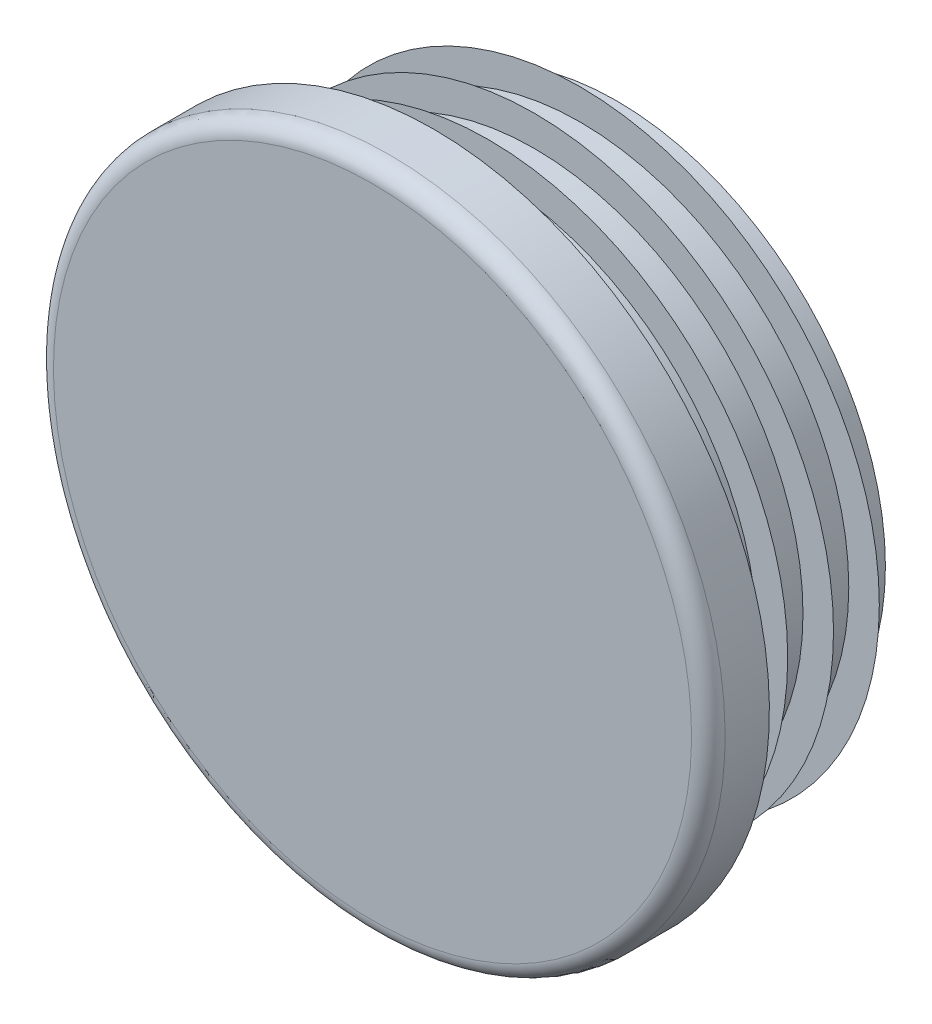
ISO-10303-21;
HEADER;
FILE_DESCRIPTION(('STEP AP214'),'2;1');
FILE_NAME('part.step','',(''),(''),'','','');
FILE_SCHEMA(('AUTOMOTIVE_DESIGN { 1 0 10303 214 1 1 1 1 }'));
ENDSEC;
DATA;
#1=APPLICATION_CONTEXT('core data for automotive mechanical design processes');
#2=APPLICATION_PROTOCOL_DEFINITION('international standard','automotive_design',2000,#1);
#3=PRODUCT_CONTEXT('',#1,'mechanical');
#4=PRODUCT('Part','Part','',(#3));
#5=PRODUCT_RELATED_PRODUCT_CATEGORY('part','',(#4));
#6=PRODUCT_DEFINITION_FORMATION('','',#4);
#7=PRODUCT_DEFINITION_CONTEXT('part definition',#1,'design');
#8=PRODUCT_DEFINITION('design','',#6,#7);
#9=PRODUCT_DEFINITION_SHAPE('','',#8);
#10=(LENGTH_UNIT() NAMED_UNIT(*) SI_UNIT(.MILLI.,.METRE.));
#11=(NAMED_UNIT(*) PLANE_ANGLE_UNIT() SI_UNIT($,.RADIAN.));
#12=(NAMED_UNIT(*) SI_UNIT($,.STERADIAN.) SOLID_ANGLE_UNIT());
#13=UNCERTAINTY_MEASURE_WITH_UNIT(LENGTH_MEASURE(1.E-05),#10,'distance_accuracy_value','');
#14=(GEOMETRIC_REPRESENTATION_CONTEXT(3) GLOBAL_UNCERTAINTY_ASSIGNED_CONTEXT((#13)) GLOBAL_UNIT_ASSIGNED_CONTEXT((#10,
#11,#12)) REPRESENTATION_CONTEXT('',''));
#15=CARTESIAN_POINT('',(0.,0.,0.));
#16=DIRECTION('',(0.,0.,1.));
#17=DIRECTION('',(1.,0.,0.));
#18=AXIS2_PLACEMENT_3D('',#15,#16,#17);
#19=CARTESIAN_POINT('',(0.,0.,5.));
#20=DIRECTION('',(0.,0.,-1.));
#21=DIRECTION('',(0.,1.,0.));
#22=AXIS2_PLACEMENT_3D('',#19,#20,#21);
#23=PLANE('',#22);
#24=CARTESIAN_POINT('',(0.,0.,5.));
#25=DIRECTION('',(0.,0.,-1.));
#26=DIRECTION('',(0.,1.,0.));
#27=AXIS2_PLACEMENT_3D('',#24,#25,#26);
#28=CIRCLE('',#27,26.125);
#29=CARTESIAN_POINT('',(0.,26.125,5.));
#30=VERTEX_POINT('',#29);
#31=EDGE_CURVE('E8',#30,#30,#28,.T.);
#32=ORIENTED_EDGE('',*,*,#31,.F.);
#33=EDGE_LOOP('',(#32));
#34=FACE_BOUND('',#33,.T.);
#35=ADVANCED_FACE('F12',(#34),#23,.F.);
#36=CARTESIAN_POINT('',(0.,0.,3.625));
#37=DIRECTION('',(0.,0.,-1.));
#38=DIRECTION('',(0.,1.,0.));
#39=AXIS2_PLACEMENT_3D('',#36,#37,#38);
#40=TOROIDAL_SURFACE('',#39,26.125,1.375);
#41=ORIENTED_EDGE('',*,*,#31,.T.);
#42=EDGE_LOOP('',(#41));
#43=FACE_BOUND('',#42,.T.);
#44=CARTESIAN_POINT('',(0.,0.,3.625));
#45=DIRECTION('',(0.,0.,-1.));
#46=DIRECTION('',(0.,1.,0.));
#47=AXIS2_PLACEMENT_3D('',#44,#45,#46);
#48=CIRCLE('',#47,27.5);
#49=CARTESIAN_POINT('',(0.,27.5,3.625));
#50=VERTEX_POINT('',#49);
#51=EDGE_CURVE('E18',#50,#50,#48,.T.);
#52=ORIENTED_EDGE('',*,*,#51,.F.);
#53=EDGE_LOOP('',(#52));
#54=FACE_BOUND('',#53,.T.);
#55=ADVANCED_FACE('F159',(#43,#54),#40,.T.);
#56=CARTESIAN_POINT('',(0.,0.,-15.));
#57=DIRECTION('',(0.,0.,-1.));
#58=DIRECTION('',(0.,1.,0.));
#59=AXIS2_PLACEMENT_3D('',#56,#57,#58);
#60=CYLINDRICAL_SURFACE('',#59,27.5);
#61=CARTESIAN_POINT('',(0.,0.,0.));
#62=DIRECTION('',(0.,0.,-1.));
#63=DIRECTION('',(0.,1.,0.));
#64=AXIS2_PLACEMENT_3D('',#61,#62,#63);
#65=CIRCLE('',#64,27.5);
#66=CARTESIAN_POINT('',(0.,27.5,0.));
#67=VERTEX_POINT('',#66);
#68=EDGE_CURVE('E22',#67,#67,#65,.T.);
#69=ORIENTED_EDGE('',*,*,#68,.F.);
#70=EDGE_LOOP('',(#69));
#71=FACE_BOUND('',#70,.T.);
#72=ORIENTED_EDGE('',*,*,#51,.T.);
#73=EDGE_LOOP('',(#72));
#74=FACE_BOUND('',#73,.T.);
#75=ADVANCED_FACE('F154',(#71,#74),#60,.T.);
#76=CARTESIAN_POINT('',(27.5,0.,0.));
#77=DIRECTION('',(0.,0.,1.));
#78=DIRECTION('',(0.,-1.,0.));
#79=AXIS2_PLACEMENT_3D('',#76,#77,#78);
#80=PLANE('',#79);
#81=CARTESIAN_POINT('',(0.,0.,0.));
#82=DIRECTION('',(0.,0.,-1.));
#83=DIRECTION('',(0.,1.,0.));
#84=AXIS2_PLACEMENT_3D('',#81,#82,#83);
#85=CIRCLE('',#84,22.);
#86=CARTESIAN_POINT('',(0.,22.,0.));
#87=VERTEX_POINT('',#86);
#88=EDGE_CURVE('E26',#87,#87,#85,.T.);
#89=ORIENTED_EDGE('',*,*,#88,.F.);
#90=EDGE_LOOP('',(#89));
#91=FACE_BOUND('',#90,.T.);
#92=ORIENTED_EDGE('',*,*,#68,.T.);
#93=EDGE_LOOP('',(#92));
#94=FACE_BOUND('',#93,.T.);
#95=ADVANCED_FACE('F148',(#91,#94),#80,.F.);
#96=CARTESIAN_POINT('',(0.,0.,-15.));
#97=DIRECTION('',(0.,0.,-1.));
#98=DIRECTION('',(0.,1.,0.));
#99=AXIS2_PLACEMENT_3D('',#96,#97,#98);
#100=CYLINDRICAL_SURFACE('',#99,22.);
#101=CARTESIAN_POINT('',(0.,0.,-0.75));
#102=DIRECTION('',(0.,0.,-1.));
#103=DIRECTION('',(0.,1.,0.));
#104=AXIS2_PLACEMENT_3D('',#101,#102,#103);
#105=CIRCLE('',#104,22.);
#106=CARTESIAN_POINT('',(0.,22.,-0.75));
#107=VERTEX_POINT('',#106);
#108=EDGE_CURVE('E31',#107,#107,#105,.T.);
#109=ORIENTED_EDGE('',*,*,#108,.F.);
#110=EDGE_LOOP('',(#109));
#111=FACE_BOUND('',#110,.T.);
#112=ORIENTED_EDGE('',*,*,#88,.T.);
#113=EDGE_LOOP('',(#112));
#114=FACE_BOUND('',#113,.T.);
#115=ADVANCED_FACE('F142',(#111,#114),#100,.T.);
#116=CARTESIAN_POINT('',(22.,0.,-0.75));
#117=DIRECTION('',(0.,0.,-1.));
#118=DIRECTION('',(0.,1.,0.));
#119=AXIS2_PLACEMENT_3D('',#116,#117,#118);
#120=PLANE('',#119);
#121=CARTESIAN_POINT('',(0.,0.,-0.75));
#122=DIRECTION('',(0.,0.,-1.));
#123=DIRECTION('',(0.,1.,0.));
#124=AXIS2_PLACEMENT_3D('',#121,#122,#123);
#125=CIRCLE('',#124,24.5);
#126=CARTESIAN_POINT('',(0.,24.5,-0.75));
#127=VERTEX_POINT('',#126);
#128=EDGE_CURVE('E34',#127,#127,#125,.T.);
#129=ORIENTED_EDGE('',*,*,#128,.F.);
#130=EDGE_LOOP('',(#129));
#131=FACE_BOUND('',#130,.T.);
#132=ORIENTED_EDGE('',*,*,#108,.T.);
#133=EDGE_LOOP('',(#132));
#134=FACE_BOUND('',#133,.T.);
#135=ADVANCED_FACE('F136',(#131,#134),#120,.F.);
#136=CARTESIAN_POINT('',(0.,0.,-0.75));
#137=DIRECTION('',(0.,0.,1.));
#138=DIRECTION('',(0.,-1.,0.));
#139=AXIS2_PLACEMENT_3D('',#136,#137,#138);
#140=CONICAL_SURFACE('',#139,24.5,0.959931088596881);
#141=CARTESIAN_POINT('',(0.,0.,-2.50051884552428));
#142=DIRECTION('',(0.,0.,-1.));
#143=DIRECTION('',(0.,1.,0.));
#144=AXIS2_PLACEMENT_3D('',#141,#142,#143);
#145=CIRCLE('',#144,22.);
#146=CARTESIAN_POINT('',(0.,22.,-2.50051884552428));
#147=VERTEX_POINT('',#146);
#148=EDGE_CURVE('E37',#147,#147,#145,.T.);
#149=ORIENTED_EDGE('',*,*,#148,.F.);
#150=EDGE_LOOP('',(#149));
#151=FACE_BOUND('',#150,.T.);
#152=ORIENTED_EDGE('',*,*,#128,.T.);
#153=EDGE_LOOP('',(#152));
#154=FACE_BOUND('',#153,.T.);
#155=ADVANCED_FACE('F130',(#151,#154),#140,.T.);
#156=CARTESIAN_POINT('',(0.,0.,-15.));
#157=DIRECTION('',(0.,0.,-1.));
#158=DIRECTION('',(0.,1.,0.));
#159=AXIS2_PLACEMENT_3D('',#156,#157,#158);
#160=CYLINDRICAL_SURFACE('',#159,22.);
#161=CARTESIAN_POINT('',(0.,0.,-4.5));
#162=DIRECTION('',(0.,0.,-1.));
#163=DIRECTION('',(0.,1.,0.));
#164=AXIS2_PLACEMENT_3D('',#161,#162,#163);
#165=CIRCLE('',#164,22.);
#166=CARTESIAN_POINT('',(0.,22.,-4.5));
#167=VERTEX_POINT('',#166);
#168=EDGE_CURVE('E40',#167,#167,#165,.T.);
#169=ORIENTED_EDGE('',*,*,#168,.F.);
#170=EDGE_LOOP('',(#169));
#171=FACE_BOUND('',#170,.T.);
#172=ORIENTED_EDGE('',*,*,#148,.T.);
#173=EDGE_LOOP('',(#172));
#174=FACE_BOUND('',#173,.T.);
#175=ADVANCED_FACE('F124',(#171,#174),#160,.T.);
#176=CARTESIAN_POINT('',(22.,0.,-4.5));
#177=DIRECTION('',(0.,0.,-1.));
#178=DIRECTION('',(0.,1.,0.));
#179=AXIS2_PLACEMENT_3D('',#176,#177,#178);
#180=PLANE('',#179);
#181=CARTESIAN_POINT('',(0.,0.,-4.5));
#182=DIRECTION('',(0.,0.,-1.));
#183=DIRECTION('',(0.,1.,0.));
#184=AXIS2_PLACEMENT_3D('',#181,#182,#183);
#185=CIRCLE('',#184,24.5);
#186=CARTESIAN_POINT('',(0.,24.5,-4.5));
#187=VERTEX_POINT('',#186);
#188=EDGE_CURVE('E43',#187,#187,#185,.T.);
#189=ORIENTED_EDGE('',*,*,#188,.F.);
#190=EDGE_LOOP('',(#189));
#191=FACE_BOUND('',#190,.T.);
#192=ORIENTED_EDGE('',*,*,#168,.T.);
#193=EDGE_LOOP('',(#192));
#194=FACE_BOUND('',#193,.T.);
#195=ADVANCED_FACE('F118',(#191,#194),#180,.F.);
#196=CARTESIAN_POINT('',(0.,0.,-4.5));
#197=DIRECTION('',(0.,0.,1.));
#198=DIRECTION('',(0.,-1.,0.));
#199=AXIS2_PLACEMENT_3D('',#196,#197,#198);
#200=CONICAL_SURFACE('',#199,24.5,0.959931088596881);
#201=CARTESIAN_POINT('',(0.,0.,-6.25051884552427));
#202=DIRECTION('',(0.,0.,-1.));
#203=DIRECTION('',(0.,1.,0.));
#204=AXIS2_PLACEMENT_3D('',#201,#202,#203);
#205=CIRCLE('',#204,22.);
#206=CARTESIAN_POINT('',(0.,22.,-6.25051884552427));
#207=VERTEX_POINT('',#206);
#208=EDGE_CURVE('E46',#207,#207,#205,.T.);
#209=ORIENTED_EDGE('',*,*,#208,.F.);
#210=EDGE_LOOP('',(#209));
#211=FACE_BOUND('',#210,.T.);
#212=ORIENTED_EDGE('',*,*,#188,.T.);
#213=EDGE_LOOP('',(#212));
#214=FACE_BOUND('',#213,.T.);
#215=ADVANCED_FACE('F112',(#211,#214),#200,.T.);
#216=CARTESIAN_POINT('',(0.,0.,-15.));
#217=DIRECTION('',(0.,0.,-1.));
#218=DIRECTION('',(0.,1.,0.));
#219=AXIS2_PLACEMENT_3D('',#216,#217,#218);
#220=CYLINDRICAL_SURFACE('',#219,22.);
#221=CARTESIAN_POINT('',(0.,0.,-8.25));
#222=DIRECTION('',(0.,0.,-1.));
#223=DIRECTION('',(0.,1.,0.));
#224=AXIS2_PLACEMENT_3D('',#221,#222,#223);
#225=CIRCLE('',#224,22.);
#226=CARTESIAN_POINT('',(0.,22.,-8.25));
#227=VERTEX_POINT('',#226);
#228=EDGE_CURVE('E49',#227,#227,#225,.T.);
#229=ORIENTED_EDGE('',*,*,#228,.F.);
#230=EDGE_LOOP('',(#229));
#231=FACE_BOUND('',#230,.T.);
#232=ORIENTED_EDGE('',*,*,#208,.T.);
#233=EDGE_LOOP('',(#232));
#234=FACE_BOUND('',#233,.T.);
#235=ADVANCED_FACE('F106',(#231,#234),#220,.T.);
#236=CARTESIAN_POINT('',(22.,0.,-8.25));
#237=DIRECTION('',(0.,0.,-1.));
#238=DIRECTION('',(0.,1.,0.));
#239=AXIS2_PLACEMENT_3D('',#236,#237,#238);
#240=PLANE('',#239);
#241=CARTESIAN_POINT('',(0.,0.,-8.25));
#242=DIRECTION('',(0.,0.,-1.));
#243=DIRECTION('',(0.,1.,0.));
#244=AXIS2_PLACEMENT_3D('',#241,#242,#243);
#245=CIRCLE('',#244,24.5);
#246=CARTESIAN_POINT('',(0.,24.5,-8.25));
#247=VERTEX_POINT('',#246);
#248=EDGE_CURVE('E52',#247,#247,#245,.T.);
#249=ORIENTED_EDGE('',*,*,#248,.F.);
#250=EDGE_LOOP('',(#249));
#251=FACE_BOUND('',#250,.T.);
#252=ORIENTED_EDGE('',*,*,#228,.T.);
#253=EDGE_LOOP('',(#252));
#254=FACE_BOUND('',#253,.T.);
#255=ADVANCED_FACE('F100',(#251,#254),#240,.F.);
#256=CARTESIAN_POINT('',(0.,0.,-8.25));
#257=DIRECTION('',(0.,0.,1.));
#258=DIRECTION('',(0.,-1.,0.));
#259=AXIS2_PLACEMENT_3D('',#256,#257,#258);
#260=CONICAL_SURFACE('',#259,24.5,0.959931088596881);
#261=CARTESIAN_POINT('',(0.,0.,-10.0005188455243));
#262=DIRECTION('',(0.,0.,-1.));
#263=DIRECTION('',(0.,1.,0.));
#264=AXIS2_PLACEMENT_3D('',#261,#262,#263);
#265=CIRCLE('',#264,22.);
#266=CARTESIAN_POINT('',(0.,22.,-10.0005188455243));
#267=VERTEX_POINT('',#266);
#268=EDGE_CURVE('E55',#267,#267,#265,.T.);
#269=ORIENTED_EDGE('',*,*,#268,.F.);
#270=EDGE_LOOP('',(#269));
#271=FACE_BOUND('',#270,.T.);
#272=ORIENTED_EDGE('',*,*,#248,.T.);
#273=EDGE_LOOP('',(#272));
#274=FACE_BOUND('',#273,.T.);
#275=ADVANCED_FACE('F94',(#271,#274),#260,.T.);
#276=CARTESIAN_POINT('',(0.,0.,-15.));
#277=DIRECTION('',(0.,0.,-1.));
#278=DIRECTION('',(0.,1.,0.));
#279=AXIS2_PLACEMENT_3D('',#276,#277,#278);
#280=CYLINDRICAL_SURFACE('',#279,22.);
#281=CARTESIAN_POINT('',(0.,0.,-12.));
#282=DIRECTION('',(0.,0.,-1.));
#283=DIRECTION('',(0.,1.,0.));
#284=AXIS2_PLACEMENT_3D('',#281,#282,#283);
#285=CIRCLE('',#284,22.);
#286=CARTESIAN_POINT('',(0.,22.,-12.));
#287=VERTEX_POINT('',#286);
#288=EDGE_CURVE('E58',#287,#287,#285,.T.);
#289=ORIENTED_EDGE('',*,*,#288,.F.);
#290=EDGE_LOOP('',(#289));
#291=FACE_BOUND('',#290,.T.);
#292=ORIENTED_EDGE('',*,*,#268,.T.);
#293=EDGE_LOOP('',(#292));
#294=FACE_BOUND('',#293,.T.);
#295=ADVANCED_FACE('F88',(#291,#294),#280,.T.);
#296=CARTESIAN_POINT('',(22.,0.,-12.));
#297=DIRECTION('',(0.,0.,-1.));
#298=DIRECTION('',(0.,1.,0.));
#299=AXIS2_PLACEMENT_3D('',#296,#297,#298);
#300=PLANE('',#299);
#301=CARTESIAN_POINT('',(0.,0.,-12.));
#302=DIRECTION('',(0.,0.,-1.));
#303=DIRECTION('',(0.,1.,0.));
#304=AXIS2_PLACEMENT_3D('',#301,#302,#303);
#305=CIRCLE('',#304,24.5);
#306=CARTESIAN_POINT('',(0.,24.5,-12.));
#307=VERTEX_POINT('',#306);
#308=EDGE_CURVE('E61',#307,#307,#305,.T.);
#309=ORIENTED_EDGE('',*,*,#308,.F.);
#310=EDGE_LOOP('',(#309));
#311=FACE_BOUND('',#310,.T.);
#312=ORIENTED_EDGE('',*,*,#288,.T.);
#313=EDGE_LOOP('',(#312));
#314=FACE_BOUND('',#313,.T.);
#315=ADVANCED_FACE('F82',(#311,#314),#300,.F.);
#316=CARTESIAN_POINT('',(0.,0.,-12.));
#317=DIRECTION('',(0.,0.,1.));
#318=DIRECTION('',(0.,-1.,0.));
#319=AXIS2_PLACEMENT_3D('',#316,#317,#318);
#320=CONICAL_SURFACE('',#319,24.5,0.959931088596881);
#321=CARTESIAN_POINT('',(0.,0.,-13.7505188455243));
#322=DIRECTION('',(0.,0.,-1.));
#323=DIRECTION('',(0.,1.,0.));
#324=AXIS2_PLACEMENT_3D('',#321,#322,#323);
#325=CIRCLE('',#324,22.);
#326=CARTESIAN_POINT('',(0.,22.,-13.7505188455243));
#327=VERTEX_POINT('',#326);
#328=EDGE_CURVE('E64',#327,#327,#325,.T.);
#329=ORIENTED_EDGE('',*,*,#328,.F.);
#330=EDGE_LOOP('',(#329));
#331=FACE_BOUND('',#330,.T.);
#332=ORIENTED_EDGE('',*,*,#308,.T.);
#333=EDGE_LOOP('',(#332));
#334=FACE_BOUND('',#333,.T.);
#335=ADVANCED_FACE('F76',(#331,#334),#320,.T.);
#336=CARTESIAN_POINT('',(0.,0.,-15.));
#337=DIRECTION('',(0.,0.,-1.));
#338=DIRECTION('',(0.,1.,0.));
#339=AXIS2_PLACEMENT_3D('',#336,#337,#338);
#340=CYLINDRICAL_SURFACE('',#339,22.);
#341=CARTESIAN_POINT('',(0.,0.,-15.));
#342=DIRECTION('',(0.,0.,-1.));
#343=DIRECTION('',(0.,1.,0.));
#344=AXIS2_PLACEMENT_3D('',#341,#342,#343);
#345=CIRCLE('',#344,22.);
#346=CARTESIAN_POINT('',(0.,22.,-15.));
#347=VERTEX_POINT('',#346);
#348=EDGE_CURVE('E67',#347,#347,#345,.T.);
#349=ORIENTED_EDGE('',*,*,#348,.F.);
#350=EDGE_LOOP('',(#349));
#351=FACE_BOUND('',#350,.T.);
#352=ORIENTED_EDGE('',*,*,#328,.T.);
#353=EDGE_LOOP('',(#352));
#354=FACE_BOUND('',#353,.T.);
#355=ADVANCED_FACE('F73',(#351,#354),#340,.T.);
#356=CARTESIAN_POINT('',(22.,0.,-15.));
#357=DIRECTION('',(0.,0.,1.));
#358=DIRECTION('',(0.,-1.,0.));
#359=AXIS2_PLACEMENT_3D('',#356,#357,#358);
#360=PLANE('',#359);
#361=ORIENTED_EDGE('',*,*,#348,.T.);
#362=EDGE_LOOP('',(#361));
#363=FACE_BOUND('',#362,.T.);
#364=ADVANCED_FACE('F71',(#363),#360,.F.);
#365=CLOSED_SHELL('',(#35,#55,#75,#95,#115,#135,#155,#175,#195,#215,#235,#255,#275,#295,#315,
#335,#355,#364));
#366=MANIFOLD_SOLID_BREP('B1',#365);
#367=ADVANCED_BREP_SHAPE_REPRESENTATION('',(#18,#366),#14);
#368=SHAPE_DEFINITION_REPRESENTATION(#9,#367);
ENDSEC;
END-ISO-10303-21;
